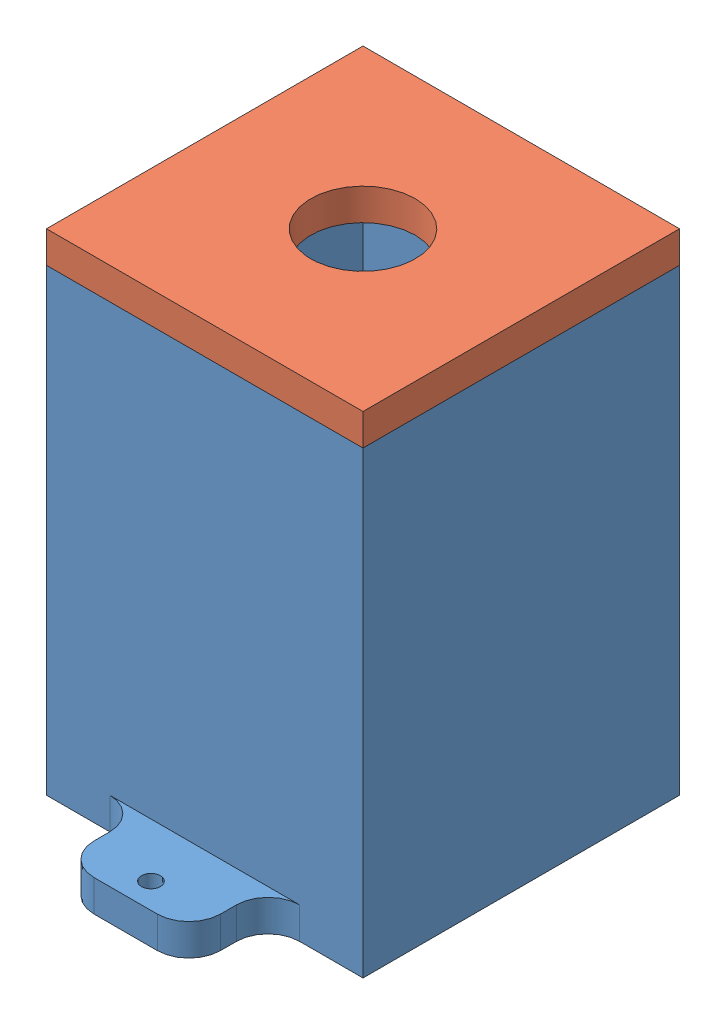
SolidWorks assembly Assem2.sldasm, configuration Default (file format 15000). Lengths in mm.
Overall size (100 155 150).
2 component instances, 2 part files, 3 mates.
Components (placement in the parent):
- Loadport_base-1: Loadport_base.SLDPRT [Default] at (59.4498 20.7009 152.4299) size (100 145 150)
- Loadport_cup-1: Loadport_cup.SLDPRT [Default] at (59.4498 160.7009 152.4299) size (100 20 100)
Mates (geometry in assembly coordinates):
- Coincident1: coincident: plane of Loadport_base-1 through (9.4498 160.7009 202.4299) normal (0 0 1); plane of Loadport_cup-1 through (9.4498 170.7009 202.4299) normal (0 0 1)
- Coincident2: coincident: plane of Loadport_base-1 through (109.4498 160.7009 202.4299) normal (1 0 0); plane of Loadport_cup-1 through (109.4498 170.7009 202.4299) normal (1 0 0)
- Coincident3: coincident anti-aligned: plane of Loadport_base-1 through (59.4498 160.7009 152.4299) normal (0 1 0); plane of Loadport_cup-1 through (59.4498 160.7009 152.4299) normal (0 -1 0)
